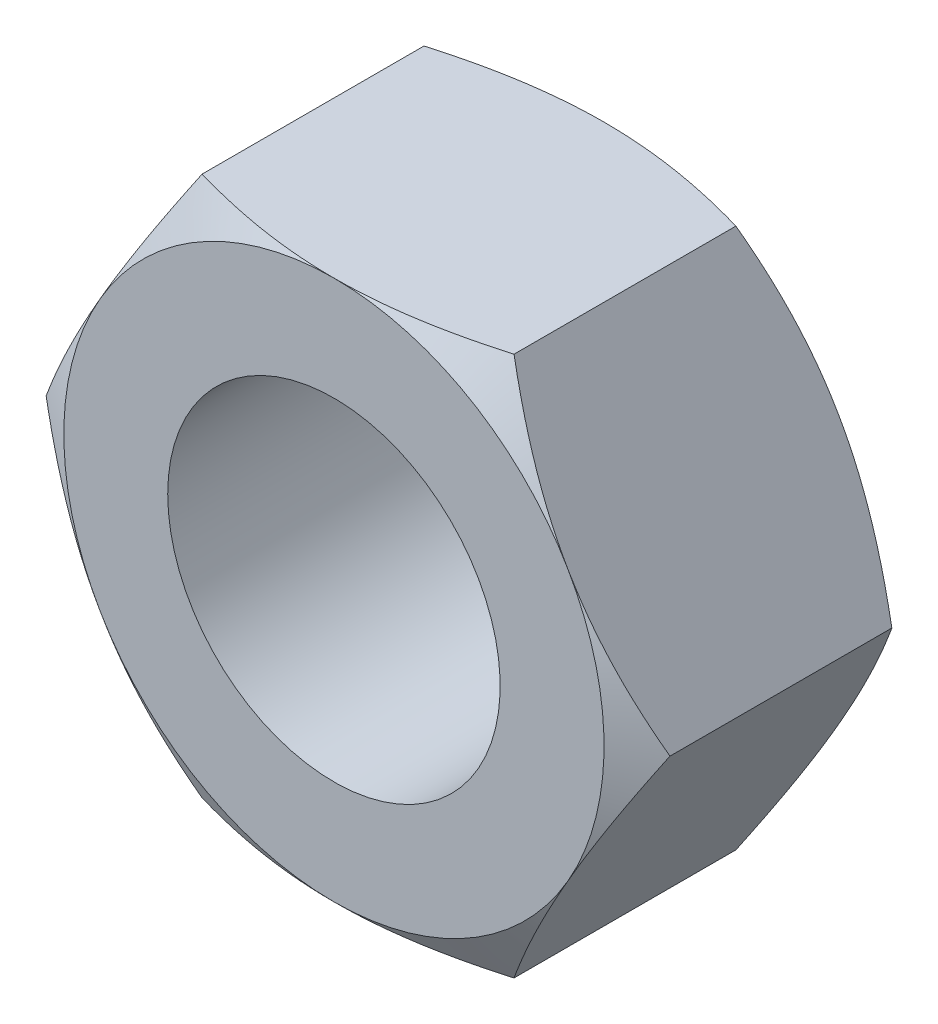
from build123d import *

# Parameters (mm, degrees)
BASE_EXTRUSION_DEPTH      = 3.25
BASE_EXTRUSION_DEPTH_BACK = 3.25
PER_AGE1_D                = 8


with BuildPart() as part:
    # Esquisse1 → Base-Extrusion (new, two sides: drawn at the far end of the back side and taken through both)
    with BuildSketch(Plane.XY.offset(-BASE_EXTRUSION_DEPTH_BACK)):
        Polygon((-3.75277675, 6.5), (3.75277675, 6.5), (7.505553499, 0), (3.75277675, -6.5), (-3.75277675, -6.5), (-7.505553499, 0), align=None)
    extrude(amount=BASE_EXTRUSION_DEPTH + BASE_EXTRUSION_DEPTH_BACK)

    # Per_age1 (through all)
    with Locations(Plane(origin=(0, 0, -3.25), x_dir=(-1, 0, 0), z_dir=(0, 0, -1))):
        with Locations((0, 0)):
            Hole(PER_AGE1_D / 2)

    # Esquisse5 → Enl_vement de mati_re-R_volution1 (revolve, cut)
    with BuildSketch(Plane(origin=(0, 0, 0), x_dir=(1, 0, 0), z_dir=(0, 1, 0)), mode=Mode.PRIVATE) as enl_vement_de_mati_re_r_volution1_sk:
        Polygon((7.505553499, 2.669443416), (7.505553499, 3.25), (6.5, 3.25), align=None)
    enl_vement_de_mati_re_r_volution1 = revolve(enl_vement_de_mati_re_r_volution1_sk.sketch.rotate(Axis((0, 0, -3.25), (0, 0, 1)), 180), axis=Axis((0, 0, -3.25), (0, 0, 1)), mode=Mode.SUBTRACT)

    # Sym_trie1: Enl_vement de mati_re-R_volution1 across plane
    add(enl_vement_de_mati_re_r_volution1.mirror(Plane.XY), mode=Mode.SUBTRACT)


solid = part.part
